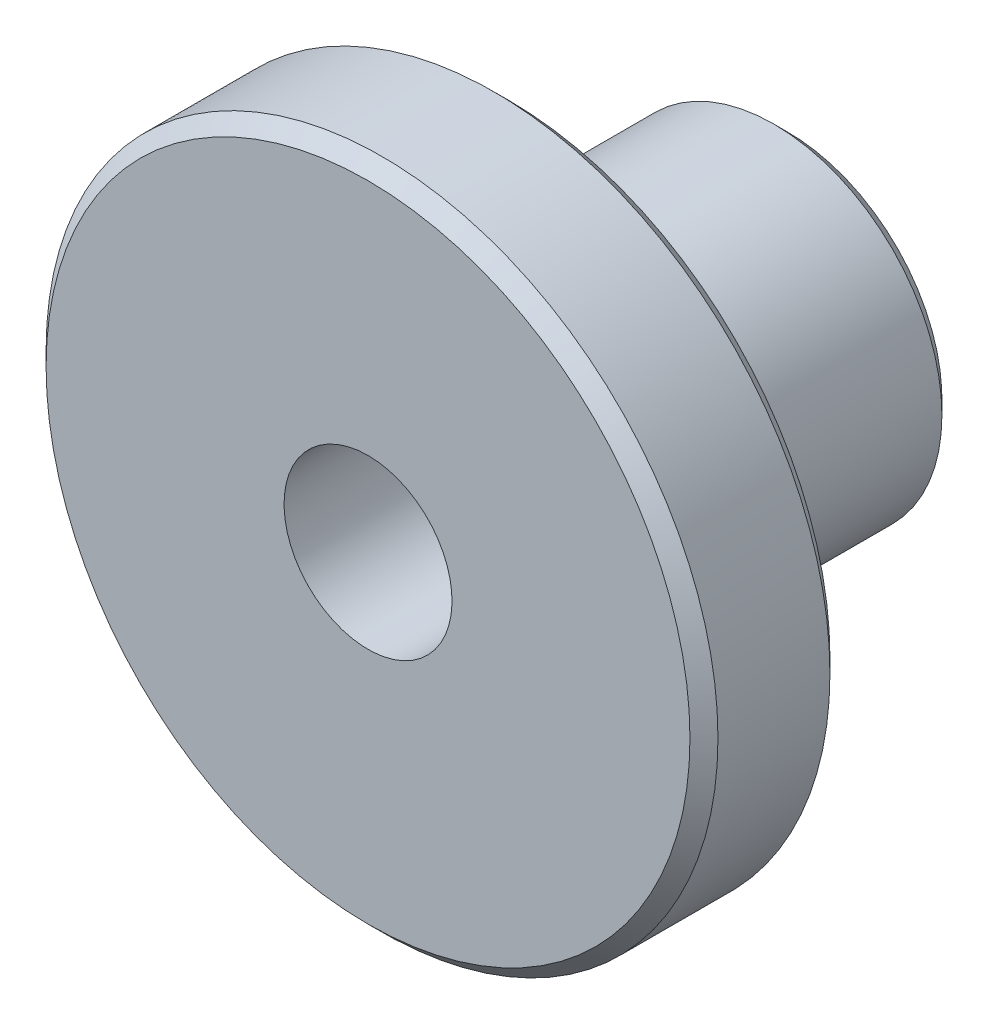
ISO-10303-21;
HEADER;
FILE_DESCRIPTION(('STEP AP214'),'2;1');
FILE_NAME('part.step','',(''),(''),'','','');
FILE_SCHEMA(('AUTOMOTIVE_DESIGN { 1 0 10303 214 1 1 1 1 }'));
ENDSEC;
DATA;
#1=APPLICATION_CONTEXT('core data for automotive mechanical design processes');
#2=APPLICATION_PROTOCOL_DEFINITION('international standard','automotive_design',2000,#1);
#3=PRODUCT_CONTEXT('',#1,'mechanical');
#4=PRODUCT('Part','Part','',(#3));
#5=PRODUCT_RELATED_PRODUCT_CATEGORY('part','',(#4));
#6=PRODUCT_DEFINITION_FORMATION('','',#4);
#7=PRODUCT_DEFINITION_CONTEXT('part definition',#1,'design');
#8=PRODUCT_DEFINITION('design','',#6,#7);
#9=PRODUCT_DEFINITION_SHAPE('','',#8);
#10=(LENGTH_UNIT() NAMED_UNIT(*) SI_UNIT(.MILLI.,.METRE.));
#11=(NAMED_UNIT(*) PLANE_ANGLE_UNIT() SI_UNIT($,.RADIAN.));
#12=(NAMED_UNIT(*) SI_UNIT($,.STERADIAN.) SOLID_ANGLE_UNIT());
#13=UNCERTAINTY_MEASURE_WITH_UNIT(LENGTH_MEASURE(1.E-05),#10,'distance_accuracy_value','');
#14=(GEOMETRIC_REPRESENTATION_CONTEXT(3) GLOBAL_UNCERTAINTY_ASSIGNED_CONTEXT((#13)) GLOBAL_UNIT_ASSIGNED_CONTEXT((#10,
#11,#12)) REPRESENTATION_CONTEXT('',''));
#15=CARTESIAN_POINT('',(0.,0.,0.));
#16=DIRECTION('',(0.,0.,1.));
#17=DIRECTION('',(1.,0.,0.));
#18=AXIS2_PLACEMENT_3D('',#15,#16,#17);
#19=CARTESIAN_POINT('',(0.,0.,0.));
#20=DIRECTION('',(0.,0.,-1.));
#21=DIRECTION('',(0.,1.,0.));
#22=AXIS2_PLACEMENT_3D('',#19,#20,#21);
#23=PLANE('',#22);
#24=CARTESIAN_POINT('',(0.,0.,0.));
#25=DIRECTION('',(0.,0.,-1.));
#26=DIRECTION('',(-1.,0.,0.));
#27=AXIS2_PLACEMENT_3D('',#24,#25,#26);
#28=CIRCLE('',#27,5.5);
#29=CARTESIAN_POINT('',(-5.5,0.,0.));
#30=VERTEX_POINT('',#29);
#31=EDGE_CURVE('E27',#30,#30,#28,.T.);
#32=ORIENTED_EDGE('',*,*,#31,.T.);
#33=EDGE_LOOP('',(#32));
#34=FACE_BOUND('',#33,.T.);
#35=CARTESIAN_POINT('',(0.,0.,0.));
#36=DIRECTION('',(0.,0.,-1.));
#37=DIRECTION('',(0.,1.,0.));
#38=AXIS2_PLACEMENT_3D('',#35,#36,#37);
#39=CIRCLE('',#38,3.);
#40=CARTESIAN_POINT('',(0.,3.,0.));
#41=VERTEX_POINT('',#40);
#42=EDGE_CURVE('E47',#41,#41,#39,.T.);
#43=ORIENTED_EDGE('',*,*,#42,.F.);
#44=EDGE_LOOP('',(#43));
#45=FACE_BOUND('',#44,.T.);
#46=ADVANCED_FACE('F12',(#34,#45),#23,.T.);
#47=CARTESIAN_POINT('',(0.,0.,-10.));
#48=DIRECTION('',(0.,0.,-1.));
#49=DIRECTION('',(0.,1.,0.));
#50=AXIS2_PLACEMENT_3D('',#47,#48,#49);
#51=CYLINDRICAL_SURFACE('',#50,6.);
#52=CARTESIAN_POINT('',(0.,0.,9.));
#53=DIRECTION('',(0.,0.,-1.));
#54=DIRECTION('',(-1.,0.,0.));
#55=AXIS2_PLACEMENT_3D('',#52,#53,#54);
#56=CIRCLE('',#55,6.);
#57=CARTESIAN_POINT('',(-6.,0.,9.));
#58=VERTEX_POINT('',#57);
#59=EDGE_CURVE('E19',#58,#58,#56,.T.);
#60=ORIENTED_EDGE('',*,*,#59,.T.);
#61=EDGE_LOOP('',(#60));
#62=FACE_BOUND('',#61,.T.);
#63=CARTESIAN_POINT('',(0.,0.,0.5));
#64=DIRECTION('',(0.,0.,-1.));
#65=DIRECTION('',(-1.,0.,0.));
#66=AXIS2_PLACEMENT_3D('',#63,#64,#65);
#67=CIRCLE('',#66,6.);
#68=CARTESIAN_POINT('',(-6.,0.,0.5));
#69=VERTEX_POINT('',#68);
#70=EDGE_CURVE('E23',#69,#69,#67,.F.);
#71=ORIENTED_EDGE('',*,*,#70,.T.);
#72=EDGE_LOOP('',(#71));
#73=FACE_BOUND('',#72,.T.);
#74=ADVANCED_FACE('F54',(#62,#73),#51,.T.);
#75=CARTESIAN_POINT('',(6.,0.,10.));
#76=DIRECTION('',(0.,0.,-1.));
#77=DIRECTION('',(0.,1.,0.));
#78=AXIS2_PLACEMENT_3D('',#75,#76,#77);
#79=PLANE('',#78);
#80=CARTESIAN_POINT('',(0.,0.,10.));
#81=DIRECTION('',(0.,0.,-1.));
#82=DIRECTION('',(-1.,0.,0.));
#83=AXIS2_PLACEMENT_3D('',#80,#81,#82);
#84=CIRCLE('',#83,7.);
#85=CARTESIAN_POINT('',(-7.,0.,10.));
#86=VERTEX_POINT('',#85);
#87=EDGE_CURVE('E8',#86,#86,#84,.F.);
#88=ORIENTED_EDGE('',*,*,#87,.T.);
#89=EDGE_LOOP('',(#88));
#90=FACE_BOUND('',#89,.T.);
#91=CARTESIAN_POINT('',(0.,0.,10.));
#92=DIRECTION('',(0.,0.,-1.));
#93=DIRECTION('',(-1.,0.,0.));
#94=AXIS2_PLACEMENT_3D('',#91,#92,#93);
#95=CIRCLE('',#94,11.5);
#96=CARTESIAN_POINT('',(-11.5,0.,10.));
#97=VERTEX_POINT('',#96);
#98=EDGE_CURVE('E41',#97,#97,#95,.T.);
#99=ORIENTED_EDGE('',*,*,#98,.T.);
#100=EDGE_LOOP('',(#99));
#101=FACE_BOUND('',#100,.T.);
#102=ADVANCED_FACE('F62',(#90,#101),#79,.T.);
#103=CARTESIAN_POINT('',(0.,0.,-10.));
#104=DIRECTION('',(0.,0.,-1.));
#105=DIRECTION('',(0.,1.,0.));
#106=AXIS2_PLACEMENT_3D('',#103,#104,#105);
#107=CYLINDRICAL_SURFACE('',#106,12.);
#108=CARTESIAN_POINT('',(0.,0.,10.5));
#109=DIRECTION('',(0.,0.,-1.));
#110=DIRECTION('',(-1.,0.,0.));
#111=AXIS2_PLACEMENT_3D('',#108,#109,#110);
#112=CIRCLE('',#111,12.);
#113=CARTESIAN_POINT('',(-12.,0.,10.5));
#114=VERTEX_POINT('',#113);
#115=EDGE_CURVE('E35',#114,#114,#112,.F.);
#116=ORIENTED_EDGE('',*,*,#115,.T.);
#117=EDGE_LOOP('',(#116));
#118=FACE_BOUND('',#117,.T.);
#119=CARTESIAN_POINT('',(0.,0.,14.5));
#120=DIRECTION('',(0.,0.,1.));
#121=DIRECTION('',(1.,0.,0.));
#122=AXIS2_PLACEMENT_3D('',#119,#120,#121);
#123=CIRCLE('',#122,12.);
#124=CARTESIAN_POINT('',(12.,0.,14.5));
#125=VERTEX_POINT('',#124);
#126=EDGE_CURVE('E38',#125,#125,#123,.F.);
#127=ORIENTED_EDGE('',*,*,#126,.T.);
#128=EDGE_LOOP('',(#127));
#129=FACE_BOUND('',#128,.T.);
#130=ADVANCED_FACE('F117',(#118,#129),#107,.T.);
#131=CARTESIAN_POINT('',(12.,0.,15.));
#132=DIRECTION('',(0.,0.,1.));
#133=DIRECTION('',(0.,-1.,0.));
#134=AXIS2_PLACEMENT_3D('',#131,#132,#133);
#135=PLANE('',#134);
#136=CARTESIAN_POINT('',(0.,0.,15.));
#137=DIRECTION('',(0.,0.,1.));
#138=DIRECTION('',(1.,0.,0.));
#139=AXIS2_PLACEMENT_3D('',#136,#137,#138);
#140=CIRCLE('',#139,11.5);
#141=CARTESIAN_POINT('',(11.5,0.,15.));
#142=VERTEX_POINT('',#141);
#143=EDGE_CURVE('E32',#142,#142,#140,.T.);
#144=ORIENTED_EDGE('',*,*,#143,.T.);
#145=EDGE_LOOP('',(#144));
#146=FACE_BOUND('',#145,.T.);
#147=CARTESIAN_POINT('',(0.,0.,15.));
#148=DIRECTION('',(0.,0.,-1.));
#149=DIRECTION('',(0.,1.,0.));
#150=AXIS2_PLACEMENT_3D('',#147,#148,#149);
#151=CIRCLE('',#150,3.);
#152=CARTESIAN_POINT('',(0.,3.,15.));
#153=VERTEX_POINT('',#152);
#154=EDGE_CURVE('E44',#153,#153,#151,.T.);
#155=ORIENTED_EDGE('',*,*,#154,.T.);
#156=EDGE_LOOP('',(#155));
#157=FACE_BOUND('',#156,.T.);
#158=ADVANCED_FACE('F106',(#146,#157),#135,.T.);
#159=CARTESIAN_POINT('',(0.,0.,15.));
#160=DIRECTION('',(0.,0.,-1.));
#161=DIRECTION('',(0.,1.,0.));
#162=AXIS2_PLACEMENT_3D('',#159,#160,#161);
#163=CYLINDRICAL_SURFACE('',#162,3.);
#164=ORIENTED_EDGE('',*,*,#154,.F.);
#165=EDGE_LOOP('',(#164));
#166=FACE_BOUND('',#165,.T.);
#167=ORIENTED_EDGE('',*,*,#42,.T.);
#168=EDGE_LOOP('',(#167));
#169=FACE_BOUND('',#168,.T.);
#170=ADVANCED_FACE('F51',(#166,#169),#163,.F.);
#171=CARTESIAN_POINT('',(0.,0.,10.));
#172=DIRECTION('',(0.,0.,1.));
#173=DIRECTION('',(1.,0.,0.));
#174=AXIS2_PLACEMENT_3D('',#171,#172,#173);
#175=CONICAL_SURFACE('',#174,11.5,0.785398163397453);
#176=ORIENTED_EDGE('',*,*,#115,.F.);
#177=EDGE_LOOP('',(#176));
#178=FACE_BOUND('',#177,.T.);
#179=ORIENTED_EDGE('',*,*,#98,.F.);
#180=EDGE_LOOP('',(#179));
#181=FACE_BOUND('',#180,.T.);
#182=ADVANCED_FACE('F66',(#178,#181),#175,.T.);
#183=CARTESIAN_POINT('',(0.,0.,14.5));
#184=DIRECTION('',(0.,0.,-1.));
#185=DIRECTION('',(-1.,0.,0.));
#186=AXIS2_PLACEMENT_3D('',#183,#184,#185);
#187=CONICAL_SURFACE('',#186,12.,0.785398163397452);
#188=ORIENTED_EDGE('',*,*,#143,.F.);
#189=EDGE_LOOP('',(#188));
#190=FACE_BOUND('',#189,.T.);
#191=ORIENTED_EDGE('',*,*,#126,.F.);
#192=EDGE_LOOP('',(#191));
#193=FACE_BOUND('',#192,.T.);
#194=ADVANCED_FACE('F69',(#190,#193),#187,.T.);
#195=CARTESIAN_POINT('',(0.,0.,0.));
#196=DIRECTION('',(0.,0.,1.));
#197=DIRECTION('',(1.,0.,0.));
#198=AXIS2_PLACEMENT_3D('',#195,#196,#197);
#199=CONICAL_SURFACE('',#198,5.5,0.785398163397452);
#200=ORIENTED_EDGE('',*,*,#70,.F.);
#201=EDGE_LOOP('',(#200));
#202=FACE_BOUND('',#201,.T.);
#203=ORIENTED_EDGE('',*,*,#31,.F.);
#204=EDGE_LOOP('',(#203));
#205=FACE_BOUND('',#204,.T.);
#206=ADVANCED_FACE('F72',(#202,#205),#199,.T.);
#207=CARTESIAN_POINT('',(0.,0.,9.));
#208=DIRECTION('',(0.,0.,-1.));
#209=DIRECTION('',(-1.,0.,0.));
#210=AXIS2_PLACEMENT_3D('',#207,#208,#209);
#211=TOROIDAL_SURFACE('',#210,7.,1.);
#212=ORIENTED_EDGE('',*,*,#87,.F.);
#213=EDGE_LOOP('',(#212));
#214=FACE_BOUND('',#213,.T.);
#215=ORIENTED_EDGE('',*,*,#59,.F.);
#216=EDGE_LOOP('',(#215));
#217=FACE_BOUND('',#216,.T.);
#218=ADVANCED_FACE('F14',(#214,#217),#211,.F.);
#219=CLOSED_SHELL('',(#46,#74,#102,#130,#158,#170,#182,#194,#206,#218));
#220=MANIFOLD_SOLID_BREP('B1',#219);
#221=ADVANCED_BREP_SHAPE_REPRESENTATION('',(#18,#220),#14);
#222=SHAPE_DEFINITION_REPRESENTATION(#9,#221);
ENDSEC;
END-ISO-10303-21;
